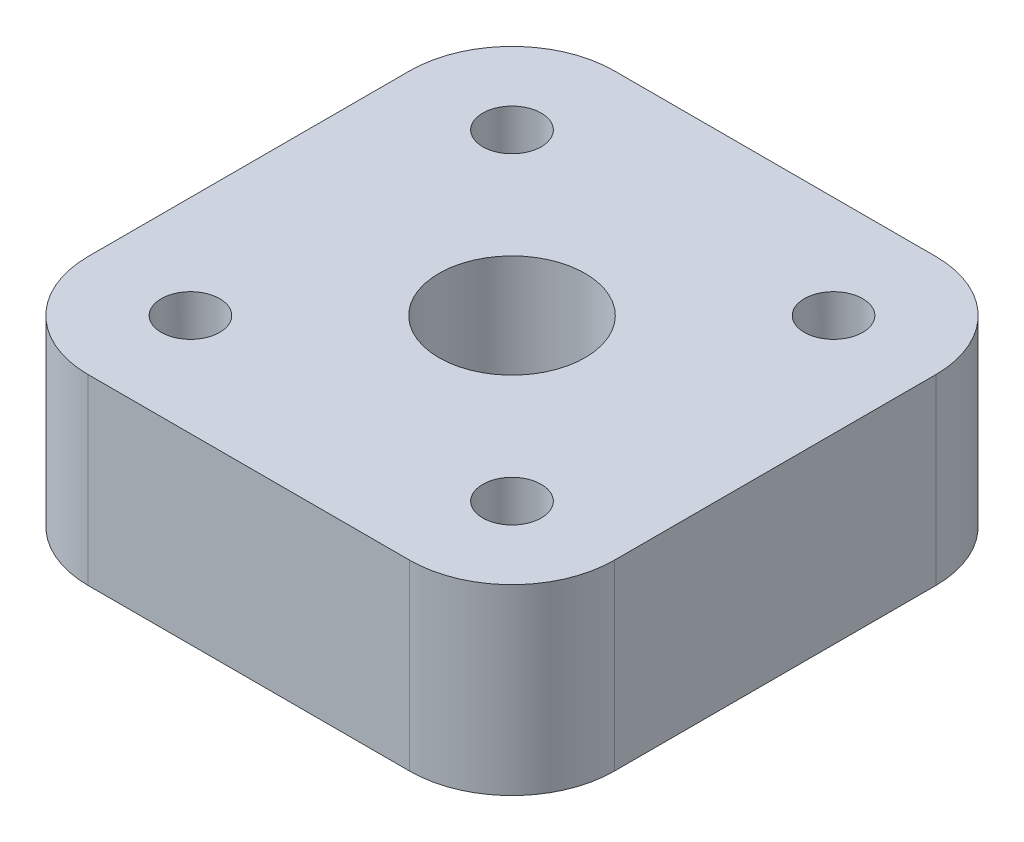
ISO-10303-21;
HEADER;
FILE_DESCRIPTION(('STEP AP214'),'2;1');
FILE_NAME('part.step','',(''),(''),'','','');
FILE_SCHEMA(('AUTOMOTIVE_DESIGN { 1 0 10303 214 1 1 1 1 }'));
ENDSEC;
DATA;
#1=APPLICATION_CONTEXT('core data for automotive mechanical design processes');
#2=APPLICATION_PROTOCOL_DEFINITION('international standard','automotive_design',2000,#1);
#3=PRODUCT_CONTEXT('',#1,'mechanical');
#4=PRODUCT('Part','Part','',(#3));
#5=PRODUCT_RELATED_PRODUCT_CATEGORY('part','',(#4));
#6=PRODUCT_DEFINITION_FORMATION('','',#4);
#7=PRODUCT_DEFINITION_CONTEXT('part definition',#1,'design');
#8=PRODUCT_DEFINITION('design','',#6,#7);
#9=PRODUCT_DEFINITION_SHAPE('','',#8);
#10=(LENGTH_UNIT() NAMED_UNIT(*) SI_UNIT(.MILLI.,.METRE.));
#11=(NAMED_UNIT(*) PLANE_ANGLE_UNIT() SI_UNIT($,.RADIAN.));
#12=(NAMED_UNIT(*) SI_UNIT($,.STERADIAN.) SOLID_ANGLE_UNIT());
#13=UNCERTAINTY_MEASURE_WITH_UNIT(LENGTH_MEASURE(1.E-05),#10,'distance_accuracy_value','');
#14=(GEOMETRIC_REPRESENTATION_CONTEXT(3) GLOBAL_UNCERTAINTY_ASSIGNED_CONTEXT((#13)) GLOBAL_UNIT_ASSIGNED_CONTEXT((#10,
#11,#12)) REPRESENTATION_CONTEXT('',''));
#15=CARTESIAN_POINT('',(0.,0.,0.));
#16=DIRECTION('',(0.,0.,1.));
#17=DIRECTION('',(1.,0.,0.));
#18=AXIS2_PLACEMENT_3D('',#15,#16,#17);
#19=CARTESIAN_POINT('',(11.,6.25,10.9999999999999));
#20=DIRECTION('',(0.,-1.,0.));
#21=DIRECTION('',(0.,0.,-1.));
#22=AXIS2_PLACEMENT_3D('',#19,#20,#21);
#23=CYLINDRICAL_SURFACE('',#22,2.);
#24=CARTESIAN_POINT('',(11.,6.25,10.9999999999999));
#25=DIRECTION('',(0.,1.,0.));
#26=DIRECTION('',(0.,0.,1.));
#27=AXIS2_PLACEMENT_3D('',#24,#25,#26);
#28=CIRCLE('',#27,2.);
#29=CARTESIAN_POINT('',(11.,6.25,12.9999999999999));
#30=VERTEX_POINT('',#29);
#31=EDGE_CURVE('E206',#30,#30,#28,.T.);
#32=ORIENTED_EDGE('',*,*,#31,.T.);
#33=EDGE_LOOP('',(#32));
#34=FACE_BOUND('',#33,.T.);
#35=CARTESIAN_POINT('',(11.,-2.25,10.9999999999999));
#36=DIRECTION('',(0.,-1.,0.));
#37=DIRECTION('',(0.,0.,-1.));
#38=AXIS2_PLACEMENT_3D('',#35,#36,#37);
#39=CIRCLE('',#38,2.);
#40=CARTESIAN_POINT('',(11.,-2.25,8.9999999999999));
#41=VERTEX_POINT('',#40);
#42=EDGE_CURVE('E49',#41,#41,#39,.T.);
#43=ORIENTED_EDGE('',*,*,#42,.T.);
#44=EDGE_LOOP('',(#43));
#45=FACE_BOUND('',#44,.T.);
#46=ADVANCED_FACE('F45',(#34,#45),#23,.F.);
#47=CARTESIAN_POINT('',(11.,6.25,-11.0000000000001));
#48=DIRECTION('',(0.,-1.,0.));
#49=DIRECTION('',(0.,0.,-1.));
#50=AXIS2_PLACEMENT_3D('',#47,#48,#49);
#51=CYLINDRICAL_SURFACE('',#50,2.);
#52=CARTESIAN_POINT('',(11.,6.25,-11.0000000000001));
#53=DIRECTION('',(0.,1.,0.));
#54=DIRECTION('',(0.,0.,1.));
#55=AXIS2_PLACEMENT_3D('',#52,#53,#54);
#56=CIRCLE('',#55,2.);
#57=CARTESIAN_POINT('',(11.,6.25,-9.0000000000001));
#58=VERTEX_POINT('',#57);
#59=EDGE_CURVE('E203',#58,#58,#56,.T.);
#60=ORIENTED_EDGE('',*,*,#59,.T.);
#61=EDGE_LOOP('',(#60));
#62=FACE_BOUND('',#61,.T.);
#63=CARTESIAN_POINT('',(11.,-2.25,-11.0000000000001));
#64=DIRECTION('',(0.,-1.,0.));
#65=DIRECTION('',(0.,0.,-1.));
#66=AXIS2_PLACEMENT_3D('',#63,#64,#65);
#67=CIRCLE('',#66,2.);
#68=CARTESIAN_POINT('',(11.,-2.25,-13.0000000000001));
#69=VERTEX_POINT('',#68);
#70=EDGE_CURVE('E181',#69,#69,#67,.T.);
#71=ORIENTED_EDGE('',*,*,#70,.T.);
#72=EDGE_LOOP('',(#71));
#73=FACE_BOUND('',#72,.T.);
#74=ADVANCED_FACE('F248',(#62,#73),#51,.F.);
#75=CARTESIAN_POINT('',(-11.,6.25,-10.9999999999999));
#76=DIRECTION('',(0.,-1.,0.));
#77=DIRECTION('',(0.,0.,-1.));
#78=AXIS2_PLACEMENT_3D('',#75,#76,#77);
#79=CYLINDRICAL_SURFACE('',#78,2.);
#80=CARTESIAN_POINT('',(-11.,6.25,-10.9999999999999));
#81=DIRECTION('',(0.,1.,0.));
#82=DIRECTION('',(0.,0.,1.));
#83=AXIS2_PLACEMENT_3D('',#80,#81,#82);
#84=CIRCLE('',#83,2.);
#85=CARTESIAN_POINT('',(-11.,6.25,-8.99999999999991));
#86=VERTEX_POINT('',#85);
#87=EDGE_CURVE('E200',#86,#86,#84,.T.);
#88=ORIENTED_EDGE('',*,*,#87,.T.);
#89=EDGE_LOOP('',(#88));
#90=FACE_BOUND('',#89,.T.);
#91=CARTESIAN_POINT('',(-11.,-2.25,-10.9999999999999));
#92=DIRECTION('',(0.,-1.,0.));
#93=DIRECTION('',(0.,0.,-1.));
#94=AXIS2_PLACEMENT_3D('',#91,#92,#93);
#95=CIRCLE('',#94,2.);
#96=CARTESIAN_POINT('',(-11.,-2.25,-12.9999999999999));
#97=VERTEX_POINT('',#96);
#98=EDGE_CURVE('E179',#97,#97,#95,.T.);
#99=ORIENTED_EDGE('',*,*,#98,.T.);
#100=EDGE_LOOP('',(#99));
#101=FACE_BOUND('',#100,.T.);
#102=ADVANCED_FACE('F254',(#90,#101),#79,.F.);
#103=CARTESIAN_POINT('',(-11.,6.25,10.9999999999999));
#104=DIRECTION('',(0.,-1.,0.));
#105=DIRECTION('',(0.,0.,-1.));
#106=AXIS2_PLACEMENT_3D('',#103,#104,#105);
#107=CYLINDRICAL_SURFACE('',#106,2.);
#108=CARTESIAN_POINT('',(-11.,6.25,10.9999999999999));
#109=DIRECTION('',(0.,1.,0.));
#110=DIRECTION('',(0.,0.,1.));
#111=AXIS2_PLACEMENT_3D('',#108,#109,#110);
#112=CIRCLE('',#111,2.);
#113=CARTESIAN_POINT('',(-11.,6.25,12.9999999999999));
#114=VERTEX_POINT('',#113);
#115=EDGE_CURVE('E177',#114,#114,#112,.T.);
#116=ORIENTED_EDGE('',*,*,#115,.T.);
#117=EDGE_LOOP('',(#116));
#118=FACE_BOUND('',#117,.T.);
#119=CARTESIAN_POINT('',(-11.,-2.25,10.9999999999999));
#120=DIRECTION('',(0.,-1.,0.));
#121=DIRECTION('',(0.,0.,-1.));
#122=AXIS2_PLACEMENT_3D('',#119,#120,#121);
#123=CIRCLE('',#122,2.);
#124=CARTESIAN_POINT('',(-11.,-2.25,8.9999999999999));
#125=VERTEX_POINT('',#124);
#126=EDGE_CURVE('E174',#125,#125,#123,.T.);
#127=ORIENTED_EDGE('',*,*,#126,.T.);
#128=EDGE_LOOP('',(#127));
#129=FACE_BOUND('',#128,.T.);
#130=ADVANCED_FACE('F264',(#118,#129),#107,.F.);
#131=CARTESIAN_POINT('',(0.,6.25,0.));
#132=DIRECTION('',(0.,1.,0.));
#133=DIRECTION('',(0.,0.,1.));
#134=AXIS2_PLACEMENT_3D('',#131,#132,#133);
#135=PLANE('',#134);
#136=ORIENTED_EDGE('',*,*,#87,.F.);
#137=EDGE_LOOP('',(#136));
#138=FACE_BOUND('',#137,.T.);
#139=ORIENTED_EDGE('',*,*,#31,.F.);
#140=EDGE_LOOP('',(#139));
#141=FACE_BOUND('',#140,.T.);
#142=DIRECTION('',(0.,0.,-1.));
#143=VECTOR('',#142,1.);
#144=CARTESIAN_POINT('',(18.,6.25,-18.));
#145=LINE('',#144,#143);
#146=CARTESIAN_POINT('',(18.,6.25,11.));
#147=VERTEX_POINT('',#146);
#148=CARTESIAN_POINT('',(18.,6.25,-11.));
#149=VERTEX_POINT('',#148);
#150=EDGE_CURVE('E151',#147,#149,#145,.T.);
#151=ORIENTED_EDGE('',*,*,#150,.T.);
#152=CARTESIAN_POINT('',(11.,6.25,-11.));
#153=DIRECTION('',(0.,1.,0.));
#154=DIRECTION('',(0.,0.,1.));
#155=AXIS2_PLACEMENT_3D('',#152,#153,#154);
#156=CIRCLE('',#155,7.);
#157=CARTESIAN_POINT('',(11.,6.25,-18.));
#158=VERTEX_POINT('',#157);
#159=EDGE_CURVE('E166',#149,#158,#156,.T.);
#160=ORIENTED_EDGE('',*,*,#159,.T.);
#161=DIRECTION('',(-1.,0.,0.));
#162=VECTOR('',#161,1.);
#163=CARTESIAN_POINT('',(-18.,6.25,-18.));
#164=LINE('',#163,#162);
#165=CARTESIAN_POINT('',(-11.,6.25,-18.));
#166=VERTEX_POINT('',#165);
#167=EDGE_CURVE('E133',#158,#166,#164,.T.);
#168=ORIENTED_EDGE('',*,*,#167,.T.);
#169=CARTESIAN_POINT('',(-11.,6.25,-11.));
#170=DIRECTION('',(0.,1.,0.));
#171=DIRECTION('',(0.,0.,1.));
#172=AXIS2_PLACEMENT_3D('',#169,#170,#171);
#173=CIRCLE('',#172,7.);
#174=CARTESIAN_POINT('',(-18.,6.25,-11.));
#175=VERTEX_POINT('',#174);
#176=EDGE_CURVE('E164',#166,#175,#173,.T.);
#177=ORIENTED_EDGE('',*,*,#176,.T.);
#178=DIRECTION('',(0.,0.,1.));
#179=VECTOR('',#178,1.);
#180=CARTESIAN_POINT('',(-18.,6.25,-18.));
#181=LINE('',#180,#179);
#182=CARTESIAN_POINT('',(-18.,6.25,11.));
#183=VERTEX_POINT('',#182);
#184=EDGE_CURVE('E217',#175,#183,#181,.T.);
#185=ORIENTED_EDGE('',*,*,#184,.T.);
#186=CARTESIAN_POINT('',(-11.,6.25,11.));
#187=DIRECTION('',(0.,1.,0.));
#188=DIRECTION('',(0.,0.,1.));
#189=AXIS2_PLACEMENT_3D('',#186,#187,#188);
#190=CIRCLE('',#189,7.);
#191=CARTESIAN_POINT('',(-11.,6.25,18.));
#192=VERTEX_POINT('',#191);
#193=EDGE_CURVE('E68',#183,#192,#190,.T.);
#194=ORIENTED_EDGE('',*,*,#193,.T.);
#195=DIRECTION('',(1.,0.,0.));
#196=VECTOR('',#195,1.);
#197=CARTESIAN_POINT('',(-18.,6.25,18.));
#198=LINE('',#197,#196);
#199=CARTESIAN_POINT('',(11.,6.25,18.));
#200=VERTEX_POINT('',#199);
#201=EDGE_CURVE('E152',#192,#200,#198,.T.);
#202=ORIENTED_EDGE('',*,*,#201,.T.);
#203=CARTESIAN_POINT('',(11.,6.25,11.));
#204=DIRECTION('',(0.,1.,0.));
#205=DIRECTION('',(0.,0.,1.));
#206=AXIS2_PLACEMENT_3D('',#203,#204,#205);
#207=CIRCLE('',#206,7.);
#208=EDGE_CURVE('E161',#200,#147,#207,.T.);
#209=ORIENTED_EDGE('',*,*,#208,.T.);
#210=EDGE_LOOP('',(#151,#160,#168,#177,#185,#194,#202,#209));
#211=FACE_BOUND('',#210,.T.);
#212=CARTESIAN_POINT('',(0.,6.25,0.));
#213=DIRECTION('',(0.,1.,0.));
#214=DIRECTION('',(0.,0.,1.));
#215=AXIS2_PLACEMENT_3D('',#212,#213,#214);
#216=CIRCLE('',#215,5.);
#217=CARTESIAN_POINT('',(0.,6.25,5.));
#218=VERTEX_POINT('',#217);
#219=EDGE_CURVE('E146',#218,#218,#216,.T.);
#220=ORIENTED_EDGE('',*,*,#219,.F.);
#221=EDGE_LOOP('',(#220));
#222=FACE_BOUND('',#221,.T.);
#223=ORIENTED_EDGE('',*,*,#59,.F.);
#224=EDGE_LOOP('',(#223));
#225=FACE_BOUND('',#224,.T.);
#226=ORIENTED_EDGE('',*,*,#115,.F.);
#227=EDGE_LOOP('',(#226));
#228=FACE_BOUND('',#227,.T.);
#229=ADVANCED_FACE('F219',(#138,#141,#211,#222,#225,#228),#135,.T.);
#230=CARTESIAN_POINT('',(0.,-6.25,0.));
#231=DIRECTION('',(0.,1.,0.));
#232=DIRECTION('',(0.,0.,1.));
#233=AXIS2_PLACEMENT_3D('',#230,#231,#232);
#234=PLANE('',#233);
#235=CARTESIAN_POINT('',(11.,-6.25,10.9999999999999));
#236=DIRECTION('',(0.,-1.,0.));
#237=DIRECTION('',(0.,0.,-1.));
#238=AXIS2_PLACEMENT_3D('',#235,#236,#237);
#239=CIRCLE('',#238,3.5);
#240=CARTESIAN_POINT('',(11.,-6.25,7.4999999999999));
#241=VERTEX_POINT('',#240);
#242=EDGE_CURVE('E409',#241,#241,#239,.T.);
#243=ORIENTED_EDGE('',*,*,#242,.F.);
#244=EDGE_LOOP('',(#243));
#245=FACE_BOUND('',#244,.T.);
#246=CARTESIAN_POINT('',(-11.,-6.25,-10.9999999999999));
#247=DIRECTION('',(0.,-1.,0.));
#248=DIRECTION('',(0.,0.,-1.));
#249=AXIS2_PLACEMENT_3D('',#246,#247,#248);
#250=CIRCLE('',#249,3.5);
#251=CARTESIAN_POINT('',(-11.,-6.25,-14.4999999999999));
#252=VERTEX_POINT('',#251);
#253=EDGE_CURVE('E417',#252,#252,#250,.T.);
#254=ORIENTED_EDGE('',*,*,#253,.F.);
#255=EDGE_LOOP('',(#254));
#256=FACE_BOUND('',#255,.T.);
#257=CARTESIAN_POINT('',(11.,-6.25,-11.0000000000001));
#258=DIRECTION('',(0.,-1.,0.));
#259=DIRECTION('',(0.,0.,-1.));
#260=AXIS2_PLACEMENT_3D('',#257,#258,#259);
#261=CIRCLE('',#260,3.5);
#262=CARTESIAN_POINT('',(11.,-6.25,-14.5000000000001));
#263=VERTEX_POINT('',#262);
#264=EDGE_CURVE('E422',#263,#263,#261,.T.);
#265=ORIENTED_EDGE('',*,*,#264,.F.);
#266=EDGE_LOOP('',(#265));
#267=FACE_BOUND('',#266,.T.);
#268=CARTESIAN_POINT('',(-11.,-6.25,10.9999999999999));
#269=DIRECTION('',(0.,-1.,0.));
#270=DIRECTION('',(0.,0.,-1.));
#271=AXIS2_PLACEMENT_3D('',#268,#269,#270);
#272=CIRCLE('',#271,3.5);
#273=CARTESIAN_POINT('',(-11.,-6.25,7.4999999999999));
#274=VERTEX_POINT('',#273);
#275=EDGE_CURVE('E187',#274,#274,#272,.T.);
#276=ORIENTED_EDGE('',*,*,#275,.F.);
#277=EDGE_LOOP('',(#276));
#278=FACE_BOUND('',#277,.T.);
#279=DIRECTION('',(-1.,0.,0.));
#280=VECTOR('',#279,1.);
#281=CARTESIAN_POINT('',(-18.,-6.25,-18.));
#282=LINE('',#281,#280);
#283=CARTESIAN_POINT('',(11.,-6.25,-18.));
#284=VERTEX_POINT('',#283);
#285=CARTESIAN_POINT('',(-11.,-6.25,-18.));
#286=VERTEX_POINT('',#285);
#287=EDGE_CURVE('E130',#284,#286,#282,.T.);
#288=ORIENTED_EDGE('',*,*,#287,.F.);
#289=CARTESIAN_POINT('',(11.,-6.25,-11.));
#290=DIRECTION('',(0.,1.,0.));
#291=DIRECTION('',(0.,0.,1.));
#292=AXIS2_PLACEMENT_3D('',#289,#290,#291);
#293=CIRCLE('',#292,7.);
#294=CARTESIAN_POINT('',(18.,-6.25,-11.));
#295=VERTEX_POINT('',#294);
#296=EDGE_CURVE('E113',#284,#295,#293,.F.);
#297=ORIENTED_EDGE('',*,*,#296,.T.);
#298=DIRECTION('',(0.,0.,-1.));
#299=VECTOR('',#298,1.);
#300=CARTESIAN_POINT('',(18.,-6.25,-18.));
#301=LINE('',#300,#299);
#302=CARTESIAN_POINT('',(18.,-6.25,11.));
#303=VERTEX_POINT('',#302);
#304=EDGE_CURVE('E141',#303,#295,#301,.T.);
#305=ORIENTED_EDGE('',*,*,#304,.F.);
#306=CARTESIAN_POINT('',(11.,-6.25,11.));
#307=DIRECTION('',(0.,1.,0.));
#308=DIRECTION('',(0.,0.,1.));
#309=AXIS2_PLACEMENT_3D('',#306,#307,#308);
#310=CIRCLE('',#309,7.);
#311=CARTESIAN_POINT('',(11.,-6.25,18.));
#312=VERTEX_POINT('',#311);
#313=EDGE_CURVE('E134',#303,#312,#310,.F.);
#314=ORIENTED_EDGE('',*,*,#313,.T.);
#315=DIRECTION('',(1.,0.,0.));
#316=VECTOR('',#315,1.);
#317=CARTESIAN_POINT('',(-18.,-6.25,18.));
#318=LINE('',#317,#316);
#319=CARTESIAN_POINT('',(-11.,-6.25,18.));
#320=VERTEX_POINT('',#319);
#321=EDGE_CURVE('E144',#320,#312,#318,.T.);
#322=ORIENTED_EDGE('',*,*,#321,.F.);
#323=CARTESIAN_POINT('',(-11.,-6.25,11.));
#324=DIRECTION('',(0.,1.,0.));
#325=DIRECTION('',(0.,0.,1.));
#326=AXIS2_PLACEMENT_3D('',#323,#324,#325);
#327=CIRCLE('',#326,7.);
#328=CARTESIAN_POINT('',(-18.,-6.25,11.));
#329=VERTEX_POINT('',#328);
#330=EDGE_CURVE('E155',#320,#329,#327,.F.);
#331=ORIENTED_EDGE('',*,*,#330,.T.);
#332=DIRECTION('',(0.,0.,1.));
#333=VECTOR('',#332,1.);
#334=CARTESIAN_POINT('',(-18.,-6.25,-18.));
#335=LINE('',#334,#333);
#336=CARTESIAN_POINT('',(-18.,-6.25,-11.));
#337=VERTEX_POINT('',#336);
#338=EDGE_CURVE('E140',#337,#329,#335,.T.);
#339=ORIENTED_EDGE('',*,*,#338,.F.);
#340=CARTESIAN_POINT('',(-11.,-6.25,-11.));
#341=DIRECTION('',(0.,1.,0.));
#342=DIRECTION('',(0.,0.,1.));
#343=AXIS2_PLACEMENT_3D('',#340,#341,#342);
#344=CIRCLE('',#343,7.);
#345=EDGE_CURVE('E124',#337,#286,#344,.F.);
#346=ORIENTED_EDGE('',*,*,#345,.T.);
#347=EDGE_LOOP('',(#288,#297,#305,#314,#322,#331,#339,#346));
#348=FACE_BOUND('',#347,.T.);
#349=CARTESIAN_POINT('',(0.,-6.25,0.));
#350=DIRECTION('',(0.,1.,0.));
#351=DIRECTION('',(0.,0.,1.));
#352=AXIS2_PLACEMENT_3D('',#349,#350,#351);
#353=CIRCLE('',#352,5.);
#354=CARTESIAN_POINT('',(0.,-6.25,5.));
#355=VERTEX_POINT('',#354);
#356=EDGE_CURVE('E209',#355,#355,#353,.T.);
#357=ORIENTED_EDGE('',*,*,#356,.T.);
#358=EDGE_LOOP('',(#357));
#359=FACE_BOUND('',#358,.T.);
#360=ADVANCED_FACE('F137',(#245,#256,#267,#278,#348,#359),#234,.F.);
#361=CARTESIAN_POINT('',(18.,6.25,-18.));
#362=DIRECTION('',(-1.,0.,0.));
#363=DIRECTION('',(0.,0.,1.));
#364=AXIS2_PLACEMENT_3D('',#361,#362,#363);
#365=PLANE('',#364);
#366=ORIENTED_EDGE('',*,*,#304,.T.);
#367=DIRECTION('',(0.,-1.,0.));
#368=VECTOR('',#367,1.);
#369=CARTESIAN_POINT('',(18.,6.25,-11.));
#370=LINE('',#369,#368);
#371=EDGE_CURVE('E118',#295,#149,#370,.F.);
#372=ORIENTED_EDGE('',*,*,#371,.T.);
#373=ORIENTED_EDGE('',*,*,#150,.F.);
#374=DIRECTION('',(0.,-1.,0.));
#375=VECTOR('',#374,1.);
#376=CARTESIAN_POINT('',(18.,6.25,11.));
#377=LINE('',#376,#375);
#378=EDGE_CURVE('E123',#147,#303,#377,.T.);
#379=ORIENTED_EDGE('',*,*,#378,.T.);
#380=EDGE_LOOP('',(#366,#372,#373,#379));
#381=FACE_BOUND('',#380,.T.);
#382=ADVANCED_FACE('F226',(#381),#365,.F.);
#383=CARTESIAN_POINT('',(-18.,6.25,-18.));
#384=DIRECTION('',(0.,0.,1.));
#385=DIRECTION('',(1.,0.,0.));
#386=AXIS2_PLACEMENT_3D('',#383,#384,#385);
#387=PLANE('',#386);
#388=ORIENTED_EDGE('',*,*,#167,.F.);
#389=DIRECTION('',(0.,-1.,0.));
#390=VECTOR('',#389,1.);
#391=CARTESIAN_POINT('',(11.,6.25,-18.));
#392=LINE('',#391,#390);
#393=EDGE_CURVE('E117',#158,#284,#392,.T.);
#394=ORIENTED_EDGE('',*,*,#393,.T.);
#395=ORIENTED_EDGE('',*,*,#287,.T.);
#396=DIRECTION('',(0.,-1.,0.));
#397=VECTOR('',#396,1.);
#398=CARTESIAN_POINT('',(-11.,6.25,-18.));
#399=LINE('',#398,#397);
#400=EDGE_CURVE('E135',#286,#166,#399,.F.);
#401=ORIENTED_EDGE('',*,*,#400,.T.);
#402=EDGE_LOOP('',(#388,#394,#395,#401));
#403=FACE_BOUND('',#402,.T.);
#404=ADVANCED_FACE('F129',(#403),#387,.F.);
#405=CARTESIAN_POINT('',(-18.,6.25,-18.));
#406=DIRECTION('',(1.,0.,0.));
#407=DIRECTION('',(0.,0.,-1.));
#408=AXIS2_PLACEMENT_3D('',#405,#406,#407);
#409=PLANE('',#408);
#410=ORIENTED_EDGE('',*,*,#184,.F.);
#411=DIRECTION('',(0.,-1.,0.));
#412=VECTOR('',#411,1.);
#413=CARTESIAN_POINT('',(-18.,6.25,-11.));
#414=LINE('',#413,#412);
#415=EDGE_CURVE('E170',#175,#337,#414,.T.);
#416=ORIENTED_EDGE('',*,*,#415,.T.);
#417=ORIENTED_EDGE('',*,*,#338,.T.);
#418=DIRECTION('',(0.,-1.,0.));
#419=VECTOR('',#418,1.);
#420=CARTESIAN_POINT('',(-18.,6.25,11.));
#421=LINE('',#420,#419);
#422=EDGE_CURVE('E168',#329,#183,#421,.F.);
#423=ORIENTED_EDGE('',*,*,#422,.T.);
#424=EDGE_LOOP('',(#410,#416,#417,#423));
#425=FACE_BOUND('',#424,.T.);
#426=ADVANCED_FACE('F234',(#425),#409,.F.);
#427=CARTESIAN_POINT('',(-18.,6.25,18.));
#428=DIRECTION('',(0.,0.,-1.));
#429=DIRECTION('',(-1.,0.,0.));
#430=AXIS2_PLACEMENT_3D('',#427,#428,#429);
#431=PLANE('',#430);
#432=ORIENTED_EDGE('',*,*,#201,.F.);
#433=DIRECTION('',(0.,-1.,0.));
#434=VECTOR('',#433,1.);
#435=CARTESIAN_POINT('',(-11.,6.25,18.));
#436=LINE('',#435,#434);
#437=EDGE_CURVE('E11',#192,#320,#436,.T.);
#438=ORIENTED_EDGE('',*,*,#437,.T.);
#439=ORIENTED_EDGE('',*,*,#321,.T.);
#440=DIRECTION('',(0.,-1.,0.));
#441=VECTOR('',#440,1.);
#442=CARTESIAN_POINT('',(11.,6.25,18.));
#443=LINE('',#442,#441);
#444=EDGE_CURVE('E54',#312,#200,#443,.F.);
#445=ORIENTED_EDGE('',*,*,#444,.T.);
#446=EDGE_LOOP('',(#432,#438,#439,#445));
#447=FACE_BOUND('',#446,.T.);
#448=ADVANCED_FACE('F228',(#447),#431,.F.);
#449=CARTESIAN_POINT('',(0.,6.25,0.));
#450=DIRECTION('',(0.,-1.,0.));
#451=DIRECTION('',(0.,0.,-1.));
#452=AXIS2_PLACEMENT_3D('',#449,#450,#451);
#453=CYLINDRICAL_SURFACE('',#452,5.);
#454=ORIENTED_EDGE('',*,*,#219,.T.);
#455=EDGE_LOOP('',(#454));
#456=FACE_BOUND('',#455,.T.);
#457=ORIENTED_EDGE('',*,*,#356,.F.);
#458=EDGE_LOOP('',(#457));
#459=FACE_BOUND('',#458,.T.);
#460=ADVANCED_FACE('F245',(#456,#459),#453,.F.);
#461=CARTESIAN_POINT('',(11.,6.25,-11.));
#462=DIRECTION('',(0.,-1.,0.));
#463=DIRECTION('',(0.,0.,-1.));
#464=AXIS2_PLACEMENT_3D('',#461,#462,#463);
#465=CYLINDRICAL_SURFACE('',#464,7.);
#466=ORIENTED_EDGE('',*,*,#159,.F.);
#467=ORIENTED_EDGE('',*,*,#371,.F.);
#468=ORIENTED_EDGE('',*,*,#296,.F.);
#469=ORIENTED_EDGE('',*,*,#393,.F.);
#470=EDGE_LOOP('',(#466,#467,#468,#469));
#471=FACE_BOUND('',#470,.T.);
#472=ADVANCED_FACE('F116',(#471),#465,.T.);
#473=CARTESIAN_POINT('',(-11.,6.25,-11.));
#474=DIRECTION('',(0.,-1.,0.));
#475=DIRECTION('',(0.,0.,-1.));
#476=AXIS2_PLACEMENT_3D('',#473,#474,#475);
#477=CYLINDRICAL_SURFACE('',#476,7.);
#478=ORIENTED_EDGE('',*,*,#176,.F.);
#479=ORIENTED_EDGE('',*,*,#400,.F.);
#480=ORIENTED_EDGE('',*,*,#345,.F.);
#481=ORIENTED_EDGE('',*,*,#415,.F.);
#482=EDGE_LOOP('',(#478,#479,#480,#481));
#483=FACE_BOUND('',#482,.T.);
#484=ADVANCED_FACE('F238',(#483),#477,.T.);
#485=CARTESIAN_POINT('',(-11.,6.25,11.));
#486=DIRECTION('',(0.,-1.,0.));
#487=DIRECTION('',(0.,0.,-1.));
#488=AXIS2_PLACEMENT_3D('',#485,#486,#487);
#489=CYLINDRICAL_SURFACE('',#488,7.);
#490=ORIENTED_EDGE('',*,*,#193,.F.);
#491=ORIENTED_EDGE('',*,*,#422,.F.);
#492=ORIENTED_EDGE('',*,*,#330,.F.);
#493=ORIENTED_EDGE('',*,*,#437,.F.);
#494=EDGE_LOOP('',(#490,#491,#492,#493));
#495=FACE_BOUND('',#494,.T.);
#496=ADVANCED_FACE('F230',(#495),#489,.T.);
#497=CARTESIAN_POINT('',(11.,6.25,11.));
#498=DIRECTION('',(0.,-1.,0.));
#499=DIRECTION('',(0.,0.,-1.));
#500=AXIS2_PLACEMENT_3D('',#497,#498,#499);
#501=CYLINDRICAL_SURFACE('',#500,7.);
#502=ORIENTED_EDGE('',*,*,#208,.F.);
#503=ORIENTED_EDGE('',*,*,#444,.F.);
#504=ORIENTED_EDGE('',*,*,#313,.F.);
#505=ORIENTED_EDGE('',*,*,#378,.F.);
#506=EDGE_LOOP('',(#502,#503,#504,#505));
#507=FACE_BOUND('',#506,.T.);
#508=ADVANCED_FACE('F47',(#507),#501,.T.);
#509=CARTESIAN_POINT('',(-11.,-2.25,10.9999999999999));
#510=DIRECTION('',(0.,-1.,0.));
#511=DIRECTION('',(0.,0.,-1.));
#512=AXIS2_PLACEMENT_3D('',#509,#510,#511);
#513=CYLINDRICAL_SURFACE('',#512,3.5);
#514=CARTESIAN_POINT('',(-11.,-2.25,10.9999999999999));
#515=DIRECTION('',(0.,-1.,0.));
#516=DIRECTION('',(0.,0.,-1.));
#517=AXIS2_PLACEMENT_3D('',#514,#515,#516);
#518=CIRCLE('',#517,3.5);
#519=CARTESIAN_POINT('',(-11.,-2.25,7.4999999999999));
#520=VERTEX_POINT('',#519);
#521=EDGE_CURVE('E178',#520,#520,#518,.T.);
#522=ORIENTED_EDGE('',*,*,#521,.F.);
#523=EDGE_LOOP('',(#522));
#524=FACE_BOUND('',#523,.T.);
#525=ORIENTED_EDGE('',*,*,#275,.T.);
#526=EDGE_LOOP('',(#525));
#527=FACE_BOUND('',#526,.T.);
#528=ADVANCED_FACE('F313',(#524,#527),#513,.F.);
#529=CARTESIAN_POINT('',(-11.,-2.25,10.9999999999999));
#530=DIRECTION('',(0.,-1.,0.));
#531=DIRECTION('',(0.,0.,-1.));
#532=AXIS2_PLACEMENT_3D('',#529,#530,#531);
#533=PLANE('',#532);
#534=ORIENTED_EDGE('',*,*,#126,.F.);
#535=EDGE_LOOP('',(#534));
#536=FACE_BOUND('',#535,.T.);
#537=ORIENTED_EDGE('',*,*,#521,.T.);
#538=EDGE_LOOP('',(#537));
#539=FACE_BOUND('',#538,.T.);
#540=ADVANCED_FACE('F348',(#536,#539),#533,.T.);
#541=CARTESIAN_POINT('',(-11.,-2.25,-10.9999999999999));
#542=DIRECTION('',(0.,-1.,0.));
#543=DIRECTION('',(0.,0.,-1.));
#544=AXIS2_PLACEMENT_3D('',#541,#542,#543);
#545=CYLINDRICAL_SURFACE('',#544,3.5);
#546=CARTESIAN_POINT('',(-11.,-2.25,-10.9999999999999));
#547=DIRECTION('',(0.,-1.,0.));
#548=DIRECTION('',(0.,0.,-1.));
#549=AXIS2_PLACEMENT_3D('',#546,#547,#548);
#550=CIRCLE('',#549,3.5);
#551=CARTESIAN_POINT('',(-11.,-2.25,-14.4999999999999));
#552=VERTEX_POINT('',#551);
#553=EDGE_CURVE('E412',#552,#552,#550,.T.);
#554=ORIENTED_EDGE('',*,*,#553,.F.);
#555=EDGE_LOOP('',(#554));
#556=FACE_BOUND('',#555,.T.);
#557=ORIENTED_EDGE('',*,*,#253,.T.);
#558=EDGE_LOOP('',(#557));
#559=FACE_BOUND('',#558,.T.);
#560=ADVANCED_FACE('F356',(#556,#559),#545,.F.);
#561=CARTESIAN_POINT('',(-11.,-2.25,-10.9999999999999));
#562=DIRECTION('',(0.,-1.,0.));
#563=DIRECTION('',(0.,0.,-1.));
#564=AXIS2_PLACEMENT_3D('',#561,#562,#563);
#565=PLANE('',#564);
#566=ORIENTED_EDGE('',*,*,#98,.F.);
#567=EDGE_LOOP('',(#566));
#568=FACE_BOUND('',#567,.T.);
#569=ORIENTED_EDGE('',*,*,#553,.T.);
#570=EDGE_LOOP('',(#569));
#571=FACE_BOUND('',#570,.T.);
#572=ADVANCED_FACE('F364',(#568,#571),#565,.T.);
#573=CARTESIAN_POINT('',(11.,-2.25,-11.0000000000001));
#574=DIRECTION('',(0.,-1.,0.));
#575=DIRECTION('',(0.,0.,-1.));
#576=AXIS2_PLACEMENT_3D('',#573,#574,#575);
#577=CYLINDRICAL_SURFACE('',#576,3.5);
#578=CARTESIAN_POINT('',(11.,-2.25,-11.0000000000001));
#579=DIRECTION('',(0.,-1.,0.));
#580=DIRECTION('',(0.,0.,-1.));
#581=AXIS2_PLACEMENT_3D('',#578,#579,#580);
#582=CIRCLE('',#581,3.5);
#583=CARTESIAN_POINT('',(11.,-2.25,-14.5000000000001));
#584=VERTEX_POINT('',#583);
#585=EDGE_CURVE('E420',#584,#584,#582,.T.);
#586=ORIENTED_EDGE('',*,*,#585,.F.);
#587=EDGE_LOOP('',(#586));
#588=FACE_BOUND('',#587,.T.);
#589=ORIENTED_EDGE('',*,*,#264,.T.);
#590=EDGE_LOOP('',(#589));
#591=FACE_BOUND('',#590,.T.);
#592=ADVANCED_FACE('F372',(#588,#591),#577,.F.);
#593=CARTESIAN_POINT('',(11.,-2.25,-11.0000000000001));
#594=DIRECTION('',(0.,-1.,0.));
#595=DIRECTION('',(0.,0.,-1.));
#596=AXIS2_PLACEMENT_3D('',#593,#594,#595);
#597=PLANE('',#596);
#598=ORIENTED_EDGE('',*,*,#70,.F.);
#599=EDGE_LOOP('',(#598));
#600=FACE_BOUND('',#599,.T.);
#601=ORIENTED_EDGE('',*,*,#585,.T.);
#602=EDGE_LOOP('',(#601));
#603=FACE_BOUND('',#602,.T.);
#604=ADVANCED_FACE('F380',(#600,#603),#597,.T.);
#605=CARTESIAN_POINT('',(11.,-2.25,10.9999999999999));
#606=DIRECTION('',(0.,-1.,0.));
#607=DIRECTION('',(0.,0.,-1.));
#608=AXIS2_PLACEMENT_3D('',#605,#606,#607);
#609=CYLINDRICAL_SURFACE('',#608,3.5);
#610=CARTESIAN_POINT('',(11.,-2.25,10.9999999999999));
#611=DIRECTION('',(0.,-1.,0.));
#612=DIRECTION('',(0.,0.,-1.));
#613=AXIS2_PLACEMENT_3D('',#610,#611,#612);
#614=CIRCLE('',#613,3.5);
#615=CARTESIAN_POINT('',(11.,-2.25,7.4999999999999));
#616=VERTEX_POINT('',#615);
#617=EDGE_CURVE('E182',#616,#616,#614,.T.);
#618=ORIENTED_EDGE('',*,*,#617,.F.);
#619=EDGE_LOOP('',(#618));
#620=FACE_BOUND('',#619,.T.);
#621=ORIENTED_EDGE('',*,*,#242,.T.);
#622=EDGE_LOOP('',(#621));
#623=FACE_BOUND('',#622,.T.);
#624=ADVANCED_FACE('F388',(#620,#623),#609,.F.);
#625=CARTESIAN_POINT('',(11.,-2.25,10.9999999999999));
#626=DIRECTION('',(0.,-1.,0.));
#627=DIRECTION('',(0.,0.,-1.));
#628=AXIS2_PLACEMENT_3D('',#625,#626,#627);
#629=PLANE('',#628);
#630=ORIENTED_EDGE('',*,*,#42,.F.);
#631=EDGE_LOOP('',(#630));
#632=FACE_BOUND('',#631,.T.);
#633=ORIENTED_EDGE('',*,*,#617,.T.);
#634=EDGE_LOOP('',(#633));
#635=FACE_BOUND('',#634,.T.);
#636=ADVANCED_FACE('F396',(#632,#635),#629,.T.);
#637=CLOSED_SHELL('',(#46,#74,#102,#130,#229,#360,#382,#404,#426,#448,#460,#472,#484,#496,#508,
#528,#540,#560,#572,#592,#604,#624,#636));
#638=MANIFOLD_SOLID_BREP('B2',#637);
#639=ADVANCED_BREP_SHAPE_REPRESENTATION('',(#18,#638),#14);
#640=SHAPE_DEFINITION_REPRESENTATION(#9,#639);
ENDSEC;
END-ISO-10303-21;
